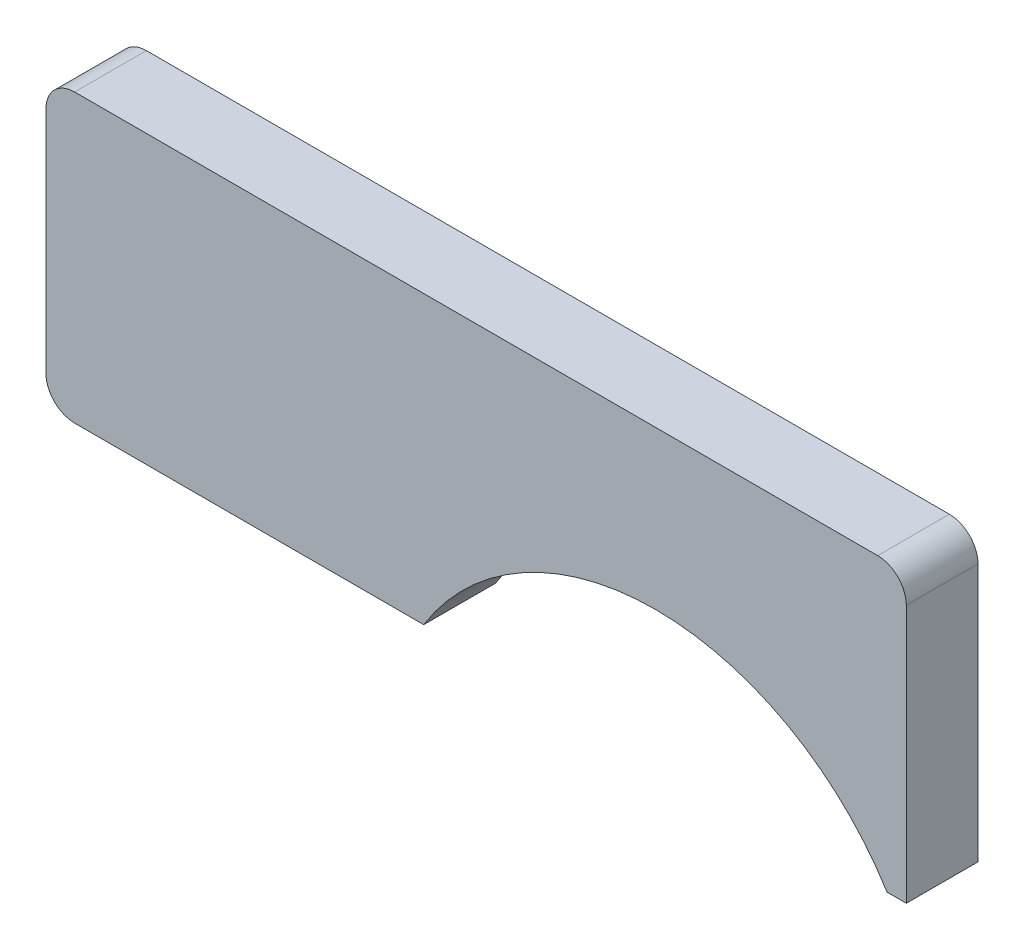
ISO-10303-21;
HEADER;
FILE_DESCRIPTION(('STEP AP214'),'2;1');
FILE_NAME('part.step','',(''),(''),'','','');
FILE_SCHEMA(('AUTOMOTIVE_DESIGN { 1 0 10303 214 1 1 1 1 }'));
ENDSEC;
DATA;
#1=APPLICATION_CONTEXT('core data for automotive mechanical design processes');
#2=APPLICATION_PROTOCOL_DEFINITION('international standard','automotive_design',2000,#1);
#3=PRODUCT_CONTEXT('',#1,'mechanical');
#4=PRODUCT('Part','Part','',(#3));
#5=PRODUCT_RELATED_PRODUCT_CATEGORY('part','',(#4));
#6=PRODUCT_DEFINITION_FORMATION('','',#4);
#7=PRODUCT_DEFINITION_CONTEXT('part definition',#1,'design');
#8=PRODUCT_DEFINITION('design','',#6,#7);
#9=PRODUCT_DEFINITION_SHAPE('','',#8);
#10=(LENGTH_UNIT() NAMED_UNIT(*) SI_UNIT(.MILLI.,.METRE.));
#11=(NAMED_UNIT(*) PLANE_ANGLE_UNIT() SI_UNIT($,.RADIAN.));
#12=(NAMED_UNIT(*) SI_UNIT($,.STERADIAN.) SOLID_ANGLE_UNIT());
#13=UNCERTAINTY_MEASURE_WITH_UNIT(LENGTH_MEASURE(1.E-05),#10,'distance_accuracy_value','');
#14=(GEOMETRIC_REPRESENTATION_CONTEXT(3) GLOBAL_UNCERTAINTY_ASSIGNED_CONTEXT((#13)) GLOBAL_UNIT_ASSIGNED_CONTEXT((#10,
#11,#12)) REPRESENTATION_CONTEXT('',''));
#15=CARTESIAN_POINT('',(0.,0.,0.));
#16=DIRECTION('',(0.,0.,1.));
#17=DIRECTION('',(1.,0.,0.));
#18=AXIS2_PLACEMENT_3D('',#15,#16,#17);
#19=CARTESIAN_POINT('',(0.,0.,3.175));
#20=DIRECTION('',(0.,0.,-1.));
#21=DIRECTION('',(-1.,0.,0.));
#22=AXIS2_PLACEMENT_3D('',#19,#20,#21);
#23=CYLINDRICAL_SURFACE('',#22,24.13);
#24=CARTESIAN_POINT('',(0.,0.,-3.175));
#25=DIRECTION('',(0.,0.,-1.));
#26=DIRECTION('',(1.,0.,0.));
#27=AXIS2_PLACEMENT_3D('',#24,#25,#26);
#28=CIRCLE('',#27,24.13);
#29=CARTESIAN_POINT('',(-20.5174779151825,12.7,-3.175));
#30=VERTEX_POINT('',#29);
#31=CARTESIAN_POINT('',(20.5174779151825,12.7,-3.175));
#32=VERTEX_POINT('',#31);
#33=EDGE_CURVE('E102',#30,#32,#28,.T.);
#34=ORIENTED_EDGE('',*,*,#33,.T.);
#35=DIRECTION('',(0.,0.,-1.));
#36=VECTOR('',#35,1.);
#37=CARTESIAN_POINT('',(20.5174779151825,12.7,3.175));
#38=LINE('',#37,#36);
#39=CARTESIAN_POINT('',(20.5174779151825,12.7,3.175));
#40=VERTEX_POINT('',#39);
#41=EDGE_CURVE('E110',#40,#32,#38,.T.);
#42=ORIENTED_EDGE('',*,*,#41,.F.);
#43=CARTESIAN_POINT('',(0.,0.,3.175));
#44=DIRECTION('',(0.,0.,-1.));
#45=DIRECTION('',(1.,0.,0.));
#46=AXIS2_PLACEMENT_3D('',#43,#44,#45);
#47=CIRCLE('',#46,24.13);
#48=CARTESIAN_POINT('',(-20.5174779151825,12.7,3.175));
#49=VERTEX_POINT('',#48);
#50=EDGE_CURVE('E132',#49,#40,#47,.T.);
#51=ORIENTED_EDGE('',*,*,#50,.F.);
#52=DIRECTION('',(0.,0.,-1.));
#53=VECTOR('',#52,1.);
#54=CARTESIAN_POINT('',(-20.5174779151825,12.7,3.175));
#55=LINE('',#54,#53);
#56=EDGE_CURVE('E121',#49,#30,#55,.T.);
#57=ORIENTED_EDGE('',*,*,#56,.T.);
#58=EDGE_LOOP('',(#34,#42,#51,#57));
#59=FACE_BOUND('',#58,.T.);
#60=ADVANCED_FACE('F27',(#59),#23,.F.);
#61=CARTESIAN_POINT('',(20.5174779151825,12.7,3.175));
#62=DIRECTION('',(0.,1.,0.));
#63=DIRECTION('',(0.,0.,1.));
#64=AXIS2_PLACEMENT_3D('',#61,#62,#63);
#65=PLANE('',#64);
#66=DIRECTION('',(1.,0.,0.));
#67=VECTOR('',#66,1.);
#68=CARTESIAN_POINT('',(20.5174779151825,12.7,-3.175));
#69=LINE('',#68,#67);
#70=CARTESIAN_POINT('',(22.225,12.7,-3.175));
#71=VERTEX_POINT('',#70);
#72=EDGE_CURVE('E97',#32,#71,#69,.T.);
#73=ORIENTED_EDGE('',*,*,#72,.T.);
#74=DIRECTION('',(0.,0.,-1.));
#75=VECTOR('',#74,1.);
#76=CARTESIAN_POINT('',(22.225,12.7,3.175));
#77=LINE('',#76,#75);
#78=CARTESIAN_POINT('',(22.225,12.7,3.175));
#79=VERTEX_POINT('',#78);
#80=EDGE_CURVE('E117',#79,#71,#77,.T.);
#81=ORIENTED_EDGE('',*,*,#80,.F.);
#82=DIRECTION('',(1.,0.,0.));
#83=VECTOR('',#82,1.);
#84=CARTESIAN_POINT('',(20.5174779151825,12.7,3.175));
#85=LINE('',#84,#83);
#86=EDGE_CURVE('E112',#40,#79,#85,.T.);
#87=ORIENTED_EDGE('',*,*,#86,.F.);
#88=ORIENTED_EDGE('',*,*,#41,.T.);
#89=EDGE_LOOP('',(#73,#81,#87,#88));
#90=FACE_BOUND('',#89,.T.);
#91=ADVANCED_FACE('F111',(#90),#65,.F.);
#92=CARTESIAN_POINT('',(22.225,38.1,3.175));
#93=DIRECTION('',(-1.,0.,0.));
#94=DIRECTION('',(0.,-1.,0.));
#95=AXIS2_PLACEMENT_3D('',#92,#93,#94);
#96=PLANE('',#95);
#97=DIRECTION('',(0.,1.,0.));
#98=VECTOR('',#97,1.);
#99=CARTESIAN_POINT('',(22.225,38.1,-3.175));
#100=LINE('',#99,#98);
#101=CARTESIAN_POINT('',(22.225,35.56,-3.175));
#102=VERTEX_POINT('',#101);
#103=EDGE_CURVE('E104',#71,#102,#100,.T.);
#104=ORIENTED_EDGE('',*,*,#103,.T.);
#105=DIRECTION('',(0.,0.,-1.));
#106=VECTOR('',#105,1.);
#107=CARTESIAN_POINT('',(22.225,35.56,3.175));
#108=LINE('',#107,#106);
#109=CARTESIAN_POINT('',(22.225,35.56,3.175));
#110=VERTEX_POINT('',#109);
#111=EDGE_CURVE('E11',#102,#110,#108,.F.);
#112=ORIENTED_EDGE('',*,*,#111,.T.);
#113=DIRECTION('',(0.,1.,0.));
#114=VECTOR('',#113,1.);
#115=CARTESIAN_POINT('',(22.225,38.1,3.175));
#116=LINE('',#115,#114);
#117=EDGE_CURVE('E135',#79,#110,#116,.T.);
#118=ORIENTED_EDGE('',*,*,#117,.F.);
#119=ORIENTED_EDGE('',*,*,#80,.T.);
#120=EDGE_LOOP('',(#104,#112,#118,#119));
#121=FACE_BOUND('',#120,.T.);
#122=ADVANCED_FACE('F189',(#121),#96,.F.);
#123=CARTESIAN_POINT('',(-53.975,38.1,3.175));
#124=DIRECTION('',(0.,-1.,0.));
#125=DIRECTION('',(0.,0.,-1.));
#126=AXIS2_PLACEMENT_3D('',#123,#124,#125);
#127=PLANE('',#126);
#128=DIRECTION('',(-1.,0.,0.));
#129=VECTOR('',#128,1.);
#130=CARTESIAN_POINT('',(-53.975,38.1,-3.175));
#131=LINE('',#130,#129);
#132=CARTESIAN_POINT('',(19.685,38.1,-3.175));
#133=VERTEX_POINT('',#132);
#134=CARTESIAN_POINT('',(-51.435,38.1,-3.175));
#135=VERTEX_POINT('',#134);
#136=EDGE_CURVE('E125',#133,#135,#131,.T.);
#137=ORIENTED_EDGE('',*,*,#136,.T.);
#138=DIRECTION('',(0.,0.,-1.));
#139=VECTOR('',#138,1.);
#140=CARTESIAN_POINT('',(-51.435,38.1,3.175));
#141=LINE('',#140,#139);
#142=CARTESIAN_POINT('',(-51.435,38.1,3.175));
#143=VERTEX_POINT('',#142);
#144=EDGE_CURVE('E34',#135,#143,#141,.F.);
#145=ORIENTED_EDGE('',*,*,#144,.T.);
#146=DIRECTION('',(-1.,0.,0.));
#147=VECTOR('',#146,1.);
#148=CARTESIAN_POINT('',(-53.975,38.1,3.175));
#149=LINE('',#148,#147);
#150=CARTESIAN_POINT('',(19.685,38.1,3.175));
#151=VERTEX_POINT('',#150);
#152=EDGE_CURVE('E137',#151,#143,#149,.T.);
#153=ORIENTED_EDGE('',*,*,#152,.F.);
#154=DIRECTION('',(0.,0.,-1.));
#155=VECTOR('',#154,1.);
#156=CARTESIAN_POINT('',(19.685,38.1,3.175));
#157=LINE('',#156,#155);
#158=EDGE_CURVE('E164',#151,#133,#157,.T.);
#159=ORIENTED_EDGE('',*,*,#158,.T.);
#160=EDGE_LOOP('',(#137,#145,#153,#159));
#161=FACE_BOUND('',#160,.T.);
#162=ADVANCED_FACE('F168',(#161),#127,.F.);
#163=CARTESIAN_POINT('',(-53.975,12.7,3.175));
#164=DIRECTION('',(1.,0.,0.));
#165=DIRECTION('',(0.,0.,-1.));
#166=AXIS2_PLACEMENT_3D('',#163,#164,#165);
#167=PLANE('',#166);
#168=DIRECTION('',(0.,-1.,0.));
#169=VECTOR('',#168,1.);
#170=CARTESIAN_POINT('',(-53.975,12.7,-3.175));
#171=LINE('',#170,#169);
#172=CARTESIAN_POINT('',(-53.975,35.56,-3.175));
#173=VERTEX_POINT('',#172);
#174=CARTESIAN_POINT('',(-53.975,15.24,-3.175));
#175=VERTEX_POINT('',#174);
#176=EDGE_CURVE('E127',#173,#175,#171,.T.);
#177=ORIENTED_EDGE('',*,*,#176,.T.);
#178=DIRECTION('',(0.,0.,-1.));
#179=VECTOR('',#178,1.);
#180=CARTESIAN_POINT('',(-53.975,15.24,3.175));
#181=LINE('',#180,#179);
#182=CARTESIAN_POINT('',(-53.975,15.24,3.175));
#183=VERTEX_POINT('',#182);
#184=EDGE_CURVE('E157',#175,#183,#181,.F.);
#185=ORIENTED_EDGE('',*,*,#184,.T.);
#186=DIRECTION('',(0.,-1.,0.));
#187=VECTOR('',#186,1.);
#188=CARTESIAN_POINT('',(-53.975,12.7,3.175));
#189=LINE('',#188,#187);
#190=CARTESIAN_POINT('',(-53.975,35.56,3.175));
#191=VERTEX_POINT('',#190);
#192=EDGE_CURVE('E139',#191,#183,#189,.T.);
#193=ORIENTED_EDGE('',*,*,#192,.F.);
#194=DIRECTION('',(0.,0.,-1.));
#195=VECTOR('',#194,1.);
#196=CARTESIAN_POINT('',(-53.975,35.56,3.175));
#197=LINE('',#196,#195);
#198=EDGE_CURVE('E154',#191,#173,#197,.T.);
#199=ORIENTED_EDGE('',*,*,#198,.T.);
#200=EDGE_LOOP('',(#177,#185,#193,#199));
#201=FACE_BOUND('',#200,.T.);
#202=ADVANCED_FACE('F177',(#201),#167,.F.);
#203=CARTESIAN_POINT('',(-53.975,12.7,3.175));
#204=DIRECTION('',(0.,1.,0.));
#205=DIRECTION('',(0.,0.,1.));
#206=AXIS2_PLACEMENT_3D('',#203,#204,#205);
#207=PLANE('',#206);
#208=DIRECTION('',(1.,0.,0.));
#209=VECTOR('',#208,1.);
#210=CARTESIAN_POINT('',(-53.975,12.7,3.175));
#211=LINE('',#210,#209);
#212=CARTESIAN_POINT('',(-51.435,12.7,3.175));
#213=VERTEX_POINT('',#212);
#214=EDGE_CURVE('E142',#213,#49,#211,.T.);
#215=ORIENTED_EDGE('',*,*,#214,.F.);
#216=DIRECTION('',(0.,0.,-1.));
#217=VECTOR('',#216,1.);
#218=CARTESIAN_POINT('',(-51.435,12.7,3.175));
#219=LINE('',#218,#217);
#220=CARTESIAN_POINT('',(-51.435,12.7,-3.175));
#221=VERTEX_POINT('',#220);
#222=EDGE_CURVE('E116',#213,#221,#219,.T.);
#223=ORIENTED_EDGE('',*,*,#222,.T.);
#224=DIRECTION('',(1.,0.,0.));
#225=VECTOR('',#224,1.);
#226=CARTESIAN_POINT('',(-53.975,12.7,-3.175));
#227=LINE('',#226,#225);
#228=EDGE_CURVE('E130',#221,#30,#227,.T.);
#229=ORIENTED_EDGE('',*,*,#228,.T.);
#230=ORIENTED_EDGE('',*,*,#56,.F.);
#231=EDGE_LOOP('',(#215,#223,#229,#230));
#232=FACE_BOUND('',#231,.T.);
#233=ADVANCED_FACE('F186',(#232),#207,.F.);
#234=CARTESIAN_POINT('',(0.,0.,3.175));
#235=DIRECTION('',(0.,0.,1.));
#236=DIRECTION('',(1.,0.,0.));
#237=AXIS2_PLACEMENT_3D('',#234,#235,#236);
#238=PLANE('',#237);
#239=ORIENTED_EDGE('',*,*,#192,.T.);
#240=CARTESIAN_POINT('',(-51.435,15.24,3.175));
#241=DIRECTION('',(0.,0.,1.));
#242=DIRECTION('',(1.,0.,0.));
#243=AXIS2_PLACEMENT_3D('',#240,#241,#242);
#244=CIRCLE('',#243,2.54);
#245=EDGE_CURVE('E162',#183,#213,#244,.T.);
#246=ORIENTED_EDGE('',*,*,#245,.T.);
#247=ORIENTED_EDGE('',*,*,#214,.T.);
#248=ORIENTED_EDGE('',*,*,#50,.T.);
#249=ORIENTED_EDGE('',*,*,#86,.T.);
#250=ORIENTED_EDGE('',*,*,#117,.T.);
#251=CARTESIAN_POINT('',(19.685,35.56,3.175));
#252=DIRECTION('',(0.,0.,1.));
#253=DIRECTION('',(1.,0.,0.));
#254=AXIS2_PLACEMENT_3D('',#251,#252,#253);
#255=CIRCLE('',#254,2.54);
#256=EDGE_CURVE('E47',#110,#151,#255,.T.);
#257=ORIENTED_EDGE('',*,*,#256,.T.);
#258=ORIENTED_EDGE('',*,*,#152,.T.);
#259=CARTESIAN_POINT('',(-51.435,35.56,3.175));
#260=DIRECTION('',(0.,0.,1.));
#261=DIRECTION('',(1.,0.,0.));
#262=AXIS2_PLACEMENT_3D('',#259,#260,#261);
#263=CIRCLE('',#262,2.54);
#264=EDGE_CURVE('E160',#143,#191,#263,.T.);
#265=ORIENTED_EDGE('',*,*,#264,.T.);
#266=EDGE_LOOP('',(#239,#246,#247,#248,#249,#250,#257,#258,#265));
#267=FACE_BOUND('',#266,.T.);
#268=ADVANCED_FACE('F180',(#267),#238,.T.);
#269=CARTESIAN_POINT('',(0.,0.,-3.175));
#270=DIRECTION('',(0.,0.,1.));
#271=DIRECTION('',(1.,0.,0.));
#272=AXIS2_PLACEMENT_3D('',#269,#270,#271);
#273=PLANE('',#272);
#274=ORIENTED_EDGE('',*,*,#228,.F.);
#275=CARTESIAN_POINT('',(-51.435,15.24,-3.175));
#276=DIRECTION('',(0.,0.,1.));
#277=DIRECTION('',(1.,0.,0.));
#278=AXIS2_PLACEMENT_3D('',#275,#276,#277);
#279=CIRCLE('',#278,2.54);
#280=EDGE_CURVE('E152',#221,#175,#279,.F.);
#281=ORIENTED_EDGE('',*,*,#280,.T.);
#282=ORIENTED_EDGE('',*,*,#176,.F.);
#283=CARTESIAN_POINT('',(-51.435,35.56,-3.175));
#284=DIRECTION('',(0.,0.,1.));
#285=DIRECTION('',(1.,0.,0.));
#286=AXIS2_PLACEMENT_3D('',#283,#284,#285);
#287=CIRCLE('',#286,2.54);
#288=EDGE_CURVE('E150',#173,#135,#287,.F.);
#289=ORIENTED_EDGE('',*,*,#288,.T.);
#290=ORIENTED_EDGE('',*,*,#136,.F.);
#291=CARTESIAN_POINT('',(19.685,35.56,-3.175));
#292=DIRECTION('',(0.,0.,1.));
#293=DIRECTION('',(1.,0.,0.));
#294=AXIS2_PLACEMENT_3D('',#291,#292,#293);
#295=CIRCLE('',#294,2.54);
#296=EDGE_CURVE('E148',#133,#102,#295,.F.);
#297=ORIENTED_EDGE('',*,*,#296,.T.);
#298=ORIENTED_EDGE('',*,*,#103,.F.);
#299=ORIENTED_EDGE('',*,*,#72,.F.);
#300=ORIENTED_EDGE('',*,*,#33,.F.);
#301=EDGE_LOOP('',(#274,#281,#282,#289,#290,#297,#298,#299,#300));
#302=FACE_BOUND('',#301,.T.);
#303=ADVANCED_FACE('F100',(#302),#273,.F.);
#304=CARTESIAN_POINT('',(-51.435,15.24,3.175));
#305=DIRECTION('',(0.,0.,-1.));
#306=DIRECTION('',(-1.,0.,0.));
#307=AXIS2_PLACEMENT_3D('',#304,#305,#306);
#308=CYLINDRICAL_SURFACE('',#307,2.54);
#309=ORIENTED_EDGE('',*,*,#245,.F.);
#310=ORIENTED_EDGE('',*,*,#184,.F.);
#311=ORIENTED_EDGE('',*,*,#280,.F.);
#312=ORIENTED_EDGE('',*,*,#222,.F.);
#313=EDGE_LOOP('',(#309,#310,#311,#312));
#314=FACE_BOUND('',#313,.T.);
#315=ADVANCED_FACE('F184',(#314),#308,.T.);
#316=CARTESIAN_POINT('',(-51.435,35.56,3.175));
#317=DIRECTION('',(0.,0.,-1.));
#318=DIRECTION('',(-1.,0.,0.));
#319=AXIS2_PLACEMENT_3D('',#316,#317,#318);
#320=CYLINDRICAL_SURFACE('',#319,2.54);
#321=ORIENTED_EDGE('',*,*,#264,.F.);
#322=ORIENTED_EDGE('',*,*,#144,.F.);
#323=ORIENTED_EDGE('',*,*,#288,.F.);
#324=ORIENTED_EDGE('',*,*,#198,.F.);
#325=EDGE_LOOP('',(#321,#322,#323,#324));
#326=FACE_BOUND('',#325,.T.);
#327=ADVANCED_FACE('F174',(#326),#320,.T.);
#328=CARTESIAN_POINT('',(19.685,35.56,3.175));
#329=DIRECTION('',(0.,0.,-1.));
#330=DIRECTION('',(-1.,0.,0.));
#331=AXIS2_PLACEMENT_3D('',#328,#329,#330);
#332=CYLINDRICAL_SURFACE('',#331,2.54);
#333=ORIENTED_EDGE('',*,*,#256,.F.);
#334=ORIENTED_EDGE('',*,*,#111,.F.);
#335=ORIENTED_EDGE('',*,*,#296,.F.);
#336=ORIENTED_EDGE('',*,*,#158,.F.);
#337=EDGE_LOOP('',(#333,#334,#335,#336));
#338=FACE_BOUND('',#337,.T.);
#339=ADVANCED_FACE('F191',(#338),#332,.T.);
#340=CLOSED_SHELL('',(#60,#91,#122,#162,#202,#233,#268,#303,#315,#327,#339));
#341=MANIFOLD_SOLID_BREP('B2',#340);
#342=ADVANCED_BREP_SHAPE_REPRESENTATION('',(#18,#341),#14);
#343=SHAPE_DEFINITION_REPRESENTATION(#9,#342);
ENDSEC;
END-ISO-10303-21;
